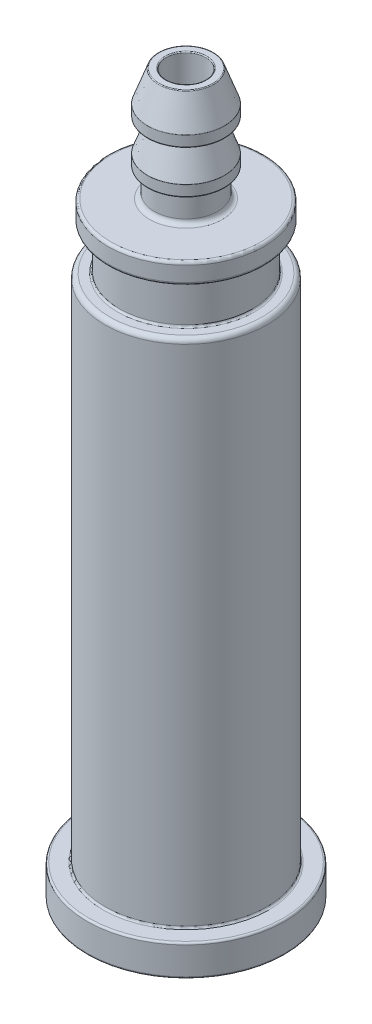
ISO-10303-21;
HEADER;
FILE_DESCRIPTION(('STEP AP214'),'2;1');
FILE_NAME('part.step','',(''),(''),'','','');
FILE_SCHEMA(('AUTOMOTIVE_DESIGN { 1 0 10303 214 1 1 1 1 }'));
ENDSEC;
DATA;
#1=APPLICATION_CONTEXT('core data for automotive mechanical design processes');
#2=APPLICATION_PROTOCOL_DEFINITION('international standard','automotive_design',2000,#1);
#3=PRODUCT_CONTEXT('',#1,'mechanical');
#4=PRODUCT('Part','Part','',(#3));
#5=PRODUCT_RELATED_PRODUCT_CATEGORY('part','',(#4));
#6=PRODUCT_DEFINITION_FORMATION('','',#4);
#7=PRODUCT_DEFINITION_CONTEXT('part definition',#1,'design');
#8=PRODUCT_DEFINITION('design','',#6,#7);
#9=PRODUCT_DEFINITION_SHAPE('','',#8);
#10=(LENGTH_UNIT() NAMED_UNIT(*) SI_UNIT(.MILLI.,.METRE.));
#11=(NAMED_UNIT(*) PLANE_ANGLE_UNIT() SI_UNIT($,.RADIAN.));
#12=(NAMED_UNIT(*) SI_UNIT($,.STERADIAN.) SOLID_ANGLE_UNIT());
#13=UNCERTAINTY_MEASURE_WITH_UNIT(LENGTH_MEASURE(1.E-05),#10,'distance_accuracy_value','');
#14=(GEOMETRIC_REPRESENTATION_CONTEXT(3) GLOBAL_UNCERTAINTY_ASSIGNED_CONTEXT((#13)) GLOBAL_UNIT_ASSIGNED_CONTEXT((#10,
#11,#12)) REPRESENTATION_CONTEXT('',''));
#15=CARTESIAN_POINT('',(0.,0.,0.));
#16=DIRECTION('',(0.,0.,1.));
#17=DIRECTION('',(1.,0.,0.));
#18=AXIS2_PLACEMENT_3D('',#15,#16,#17);
#19=CARTESIAN_POINT('',(7.62500000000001,0.5,0.));
#20=DIRECTION('',(0.,-1.,0.));
#21=DIRECTION('',(0.,0.,-1.));
#22=AXIS2_PLACEMENT_3D('',#19,#20,#21);
#23=PLANE('',#22);
#24=CARTESIAN_POINT('',(0.,0.5,0.));
#25=DIRECTION('',(0.,-1.,0.));
#26=DIRECTION('',(0.,0.,-1.));
#27=AXIS2_PLACEMENT_3D('',#24,#25,#26);
#28=CIRCLE('',#27,7.825);
#29=CARTESIAN_POINT('',(0.,0.5,-7.825));
#30=VERTEX_POINT('',#29);
#31=EDGE_CURVE('E58',#30,#30,#28,.F.);
#32=ORIENTED_EDGE('',*,*,#31,.T.);
#33=EDGE_LOOP('',(#32));
#34=FACE_BOUND('',#33,.T.);
#35=CARTESIAN_POINT('',(0.,0.5,0.));
#36=DIRECTION('',(0.,-1.,0.));
#37=DIRECTION('',(0.,0.,-1.));
#38=AXIS2_PLACEMENT_3D('',#35,#36,#37);
#39=CIRCLE('',#38,8.67759001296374);
#40=CARTESIAN_POINT('',(0.,0.5,-8.67759001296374));
#41=VERTEX_POINT('',#40);
#42=EDGE_CURVE('E61',#41,#41,#39,.T.);
#43=ORIENTED_EDGE('',*,*,#42,.T.);
#44=EDGE_LOOP('',(#43));
#45=FACE_BOUND('',#44,.T.);
#46=ADVANCED_FACE('F29',(#34,#45),#23,.T.);
#47=CARTESIAN_POINT('',(0.,0.5,0.));
#48=DIRECTION('',(0.,-1.,0.));
#49=DIRECTION('',(0.,0.,-1.));
#50=AXIS2_PLACEMENT_3D('',#47,#48,#49);
#51=CONICAL_SURFACE('',#50,8.75,0.876058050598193);
#52=CARTESIAN_POINT('',(0.,0.0463557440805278,0.));
#53=DIRECTION('',(0.,1.,0.));
#54=DIRECTION('',(0.,0.,1.));
#55=AXIS2_PLACEMENT_3D('',#52,#53,#54);
#56=CIRCLE('',#55,9.29437310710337);
#57=CARTESIAN_POINT('',(0.,0.0463557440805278,9.29437310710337));
#58=VERTEX_POINT('',#57);
#59=EDGE_CURVE('E79',#58,#58,#56,.F.);
#60=ORIENTED_EDGE('',*,*,#59,.T.);
#61=EDGE_LOOP('',(#60));
#62=FACE_BOUND('',#61,.T.);
#63=CARTESIAN_POINT('',(0.,0.453644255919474,0.));
#64=DIRECTION('',(0.,-1.,0.));
#65=DIRECTION('',(0.,0.,-1.));
#66=AXIS2_PLACEMENT_3D('',#63,#64,#65);
#67=CIRCLE('',#66,8.80562689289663);
#68=CARTESIAN_POINT('',(0.,0.453644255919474,-8.80562689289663));
#69=VERTEX_POINT('',#68);
#70=EDGE_CURVE('E82',#69,#69,#67,.F.);
#71=ORIENTED_EDGE('',*,*,#70,.T.);
#72=EDGE_LOOP('',(#71));
#73=FACE_BOUND('',#72,.T.);
#74=ADVANCED_FACE('F203',(#62,#73),#51,.F.);
#75=CARTESIAN_POINT('',(9.35,0.,0.));
#76=DIRECTION('',(0.,-1.,0.));
#77=DIRECTION('',(0.,0.,-1.));
#78=AXIS2_PLACEMENT_3D('',#75,#76,#77);
#79=PLANE('',#78);
#80=CARTESIAN_POINT('',(0.,0.,0.));
#81=DIRECTION('',(0.,-1.,0.));
#82=DIRECTION('',(0.,0.,-1.));
#83=AXIS2_PLACEMENT_3D('',#80,#81,#82);
#84=CIRCLE('',#83,9.42240998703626);
#85=CARTESIAN_POINT('',(0.,0.,-9.42240998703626));
#86=VERTEX_POINT('',#85);
#87=EDGE_CURVE('E73',#86,#86,#84,.F.);
#88=ORIENTED_EDGE('',*,*,#87,.T.);
#89=EDGE_LOOP('',(#88));
#90=FACE_BOUND('',#89,.T.);
#91=CARTESIAN_POINT('',(0.,0.,0.));
#92=DIRECTION('',(0.,-1.,0.));
#93=DIRECTION('',(0.,0.,-1.));
#94=AXIS2_PLACEMENT_3D('',#91,#92,#93);
#95=CIRCLE('',#94,9.57759001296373);
#96=CARTESIAN_POINT('',(0.,0.,-9.57759001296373));
#97=VERTEX_POINT('',#96);
#98=EDGE_CURVE('E76',#97,#97,#95,.T.);
#99=ORIENTED_EDGE('',*,*,#98,.T.);
#100=EDGE_LOOP('',(#99));
#101=FACE_BOUND('',#100,.T.);
#102=ADVANCED_FACE('F209',(#90,#101),#79,.T.);
#103=CARTESIAN_POINT('',(0.,0.,0.));
#104=DIRECTION('',(0.,1.,0.));
#105=DIRECTION('',(0.,0.,1.));
#106=AXIS2_PLACEMENT_3D('',#103,#104,#105);
#107=CONICAL_SURFACE('',#106,9.65,0.876058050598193);
#108=CARTESIAN_POINT('',(0.,0.0463557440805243,0.));
#109=DIRECTION('',(0.,-1.,0.));
#110=DIRECTION('',(0.,0.,-1.));
#111=AXIS2_PLACEMENT_3D('',#108,#109,#110);
#112=CIRCLE('',#111,9.70562689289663);
#113=CARTESIAN_POINT('',(0.,0.0463557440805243,-9.70562689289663));
#114=VERTEX_POINT('',#113);
#115=EDGE_CURVE('E67',#114,#114,#112,.F.);
#116=ORIENTED_EDGE('',*,*,#115,.T.);
#117=EDGE_LOOP('',(#116));
#118=FACE_BOUND('',#117,.T.);
#119=CARTESIAN_POINT('',(0.,0.453644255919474,0.));
#120=DIRECTION('',(0.,1.,0.));
#121=DIRECTION('',(0.,0.,1.));
#122=AXIS2_PLACEMENT_3D('',#119,#120,#121);
#123=CIRCLE('',#122,10.1943731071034);
#124=CARTESIAN_POINT('',(0.,0.453644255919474,10.1943731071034));
#125=VERTEX_POINT('',#124);
#126=EDGE_CURVE('E70',#125,#125,#123,.F.);
#127=ORIENTED_EDGE('',*,*,#126,.T.);
#128=EDGE_LOOP('',(#127));
#129=FACE_BOUND('',#128,.T.);
#130=ADVANCED_FACE('F311',(#118,#129),#107,.T.);
#131=CARTESIAN_POINT('',(10.25,0.5,0.));
#132=DIRECTION('',(0.,-1.,0.));
#133=DIRECTION('',(0.,0.,-1.));
#134=AXIS2_PLACEMENT_3D('',#131,#132,#133);
#135=PLANE('',#134);
#136=CARTESIAN_POINT('',(0.,0.5,0.));
#137=DIRECTION('',(0.,-1.,0.));
#138=DIRECTION('',(0.,0.,-1.));
#139=AXIS2_PLACEMENT_3D('',#136,#137,#138);
#140=CIRCLE('',#139,10.3224099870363);
#141=CARTESIAN_POINT('',(0.,0.5,-10.3224099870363));
#142=VERTEX_POINT('',#141);
#143=EDGE_CURVE('E52',#142,#142,#140,.F.);
#144=ORIENTED_EDGE('',*,*,#143,.T.);
#145=EDGE_LOOP('',(#144));
#146=FACE_BOUND('',#145,.T.);
#147=CARTESIAN_POINT('',(0.,0.5,0.));
#148=DIRECTION('',(0.,-1.,0.));
#149=DIRECTION('',(0.,0.,-1.));
#150=AXIS2_PLACEMENT_3D('',#147,#148,#149);
#151=CIRCLE('',#150,10.4);
#152=CARTESIAN_POINT('',(0.,0.5,-10.4));
#153=VERTEX_POINT('',#152);
#154=EDGE_CURVE('E55',#153,#153,#151,.T.);
#155=ORIENTED_EDGE('',*,*,#154,.T.);
#156=EDGE_LOOP('',(#155));
#157=FACE_BOUND('',#156,.T.);
#158=ADVANCED_FACE('F302',(#146,#157),#135,.T.);
#159=CARTESIAN_POINT('',(0.,0.,0.));
#160=DIRECTION('',(0.,-1.,0.));
#161=DIRECTION('',(0.,0.,-1.));
#162=AXIS2_PLACEMENT_3D('',#159,#160,#161);
#163=CYLINDRICAL_SURFACE('',#162,10.6);
#164=CARTESIAN_POINT('',(0.,0.7,0.));
#165=DIRECTION('',(0.,-1.,0.));
#166=DIRECTION('',(0.,0.,-1.));
#167=AXIS2_PLACEMENT_3D('',#164,#165,#166);
#168=CIRCLE('',#167,10.6);
#169=CARTESIAN_POINT('',(0.,0.7,-10.6));
#170=VERTEX_POINT('',#169);
#171=EDGE_CURVE('E44',#170,#170,#168,.F.);
#172=ORIENTED_EDGE('',*,*,#171,.T.);
#173=EDGE_LOOP('',(#172));
#174=FACE_BOUND('',#173,.T.);
#175=CARTESIAN_POINT('',(0.,3.65,0.));
#176=DIRECTION('',(0.,1.,0.));
#177=DIRECTION('',(0.,0.,1.));
#178=AXIS2_PLACEMENT_3D('',#175,#176,#177);
#179=CIRCLE('',#178,10.6);
#180=CARTESIAN_POINT('',(0.,3.65,10.6));
#181=VERTEX_POINT('',#180);
#182=EDGE_CURVE('E49',#181,#181,#179,.F.);
#183=ORIENTED_EDGE('',*,*,#182,.T.);
#184=EDGE_LOOP('',(#183));
#185=FACE_BOUND('',#184,.T.);
#186=ADVANCED_FACE('F299',(#174,#185),#163,.T.);
#187=CARTESIAN_POINT('',(10.6,3.85,0.));
#188=DIRECTION('',(0.,1.,0.));
#189=DIRECTION('',(0.,0.,1.));
#190=AXIS2_PLACEMENT_3D('',#187,#188,#189);
#191=PLANE('',#190);
#192=CARTESIAN_POINT('',(0.,3.85,0.));
#193=DIRECTION('',(0.,1.,0.));
#194=DIRECTION('',(0.,0.,1.));
#195=AXIS2_PLACEMENT_3D('',#192,#193,#194);
#196=CIRCLE('',#195,10.4);
#197=CARTESIAN_POINT('',(0.,3.85,10.4));
#198=VERTEX_POINT('',#197);
#199=EDGE_CURVE('E36',#198,#198,#196,.T.);
#200=ORIENTED_EDGE('',*,*,#199,.T.);
#201=EDGE_LOOP('',(#200));
#202=FACE_BOUND('',#201,.T.);
#203=CARTESIAN_POINT('',(0.,3.85,0.));
#204=DIRECTION('',(0.,1.,0.));
#205=DIRECTION('',(0.,0.,1.));
#206=AXIS2_PLACEMENT_3D('',#203,#204,#205);
#207=CIRCLE('',#206,8.875);
#208=CARTESIAN_POINT('',(0.,3.85,8.875));
#209=VERTEX_POINT('',#208);
#210=EDGE_CURVE('E40',#209,#209,#207,.F.);
#211=ORIENTED_EDGE('',*,*,#210,.T.);
#212=EDGE_LOOP('',(#211));
#213=FACE_BOUND('',#212,.T.);
#214=ADVANCED_FACE('F301',(#202,#213),#191,.T.);
#215=CARTESIAN_POINT('',(0.,0.,0.));
#216=DIRECTION('',(0.,-1.,0.));
#217=DIRECTION('',(0.,0.,-1.));
#218=AXIS2_PLACEMENT_3D('',#215,#216,#217);
#219=CYLINDRICAL_SURFACE('',#218,8.675);
#220=CARTESIAN_POINT('',(0.,4.05,0.));
#221=DIRECTION('',(0.,1.,0.));
#222=DIRECTION('',(0.,0.,1.));
#223=AXIS2_PLACEMENT_3D('',#220,#221,#222);
#224=CIRCLE('',#223,8.675);
#225=CARTESIAN_POINT('',(0.,4.05,8.675));
#226=VERTEX_POINT('',#225);
#227=EDGE_CURVE('E10',#226,#226,#224,.T.);
#228=ORIENTED_EDGE('',*,*,#227,.T.);
#229=EDGE_LOOP('',(#228));
#230=FACE_BOUND('',#229,.T.);
#231=CARTESIAN_POINT('',(0.,58.,0.));
#232=DIRECTION('',(0.,1.,0.));
#233=DIRECTION('',(0.,0.,1.));
#234=AXIS2_PLACEMENT_3D('',#231,#232,#233);
#235=CIRCLE('',#234,8.675);
#236=CARTESIAN_POINT('',(0.,58.,8.675));
#237=VERTEX_POINT('',#236);
#238=EDGE_CURVE('E142',#237,#237,#235,.F.);
#239=ORIENTED_EDGE('',*,*,#238,.T.);
#240=EDGE_LOOP('',(#239));
#241=FACE_BOUND('',#240,.T.);
#242=ADVANCED_FACE('F309',(#230,#241),#219,.T.);
#243=CARTESIAN_POINT('',(8.675,58.5,0.));
#244=DIRECTION('',(0.,1.,0.));
#245=DIRECTION('',(0.,0.,1.));
#246=AXIS2_PLACEMENT_3D('',#243,#244,#245);
#247=PLANE('',#246);
#248=CARTESIAN_POINT('',(0.,58.5,0.));
#249=DIRECTION('',(0.,1.,0.));
#250=DIRECTION('',(0.,0.,1.));
#251=AXIS2_PLACEMENT_3D('',#248,#249,#250);
#252=CIRCLE('',#251,8.175);
#253=CARTESIAN_POINT('',(0.,58.5,8.175));
#254=VERTEX_POINT('',#253);
#255=EDGE_CURVE('E139',#254,#254,#252,.T.);
#256=ORIENTED_EDGE('',*,*,#255,.T.);
#257=EDGE_LOOP('',(#256));
#258=FACE_BOUND('',#257,.T.);
#259=CARTESIAN_POINT('',(0.,58.5,0.));
#260=DIRECTION('',(0.,1.,0.));
#261=DIRECTION('',(0.,0.,1.));
#262=AXIS2_PLACEMENT_3D('',#259,#260,#261);
#263=CIRCLE('',#262,7.3);
#264=CARTESIAN_POINT('',(0.,58.5,7.3));
#265=VERTEX_POINT('',#264);
#266=EDGE_CURVE('E154',#265,#265,#263,.F.);
#267=ORIENTED_EDGE('',*,*,#266,.T.);
#268=EDGE_LOOP('',(#267));
#269=FACE_BOUND('',#268,.T.);
#270=ADVANCED_FACE('F360',(#258,#269),#247,.T.);
#271=CARTESIAN_POINT('',(0.,0.,0.));
#272=DIRECTION('',(0.,-1.,0.));
#273=DIRECTION('',(0.,0.,-1.));
#274=AXIS2_PLACEMENT_3D('',#271,#272,#273);
#275=CYLINDRICAL_SURFACE('',#274,7.1);
#276=CARTESIAN_POINT('',(0.,58.7,0.));
#277=DIRECTION('',(0.,1.,0.));
#278=DIRECTION('',(0.,0.,1.));
#279=AXIS2_PLACEMENT_3D('',#276,#277,#278);
#280=CIRCLE('',#279,7.1);
#281=CARTESIAN_POINT('',(0.,58.7,7.1));
#282=VERTEX_POINT('',#281);
#283=EDGE_CURVE('E148',#282,#282,#280,.T.);
#284=ORIENTED_EDGE('',*,*,#283,.T.);
#285=EDGE_LOOP('',(#284));
#286=FACE_BOUND('',#285,.T.);
#287=CARTESIAN_POINT('',(0.,63.,0.));
#288=DIRECTION('',(0.,-1.,0.));
#289=DIRECTION('',(0.,0.,-1.));
#290=AXIS2_PLACEMENT_3D('',#287,#288,#289);
#291=CIRCLE('',#290,7.1);
#292=CARTESIAN_POINT('',(0.,63.,-7.1));
#293=VERTEX_POINT('',#292);
#294=EDGE_CURVE('E151',#293,#293,#291,.T.);
#295=ORIENTED_EDGE('',*,*,#294,.T.);
#296=EDGE_LOOP('',(#295));
#297=FACE_BOUND('',#296,.T.);
#298=ADVANCED_FACE('F628',(#286,#297),#275,.T.);
#299=CARTESIAN_POINT('',(7.1,63.2,0.));
#300=DIRECTION('',(0.,-1.,0.));
#301=DIRECTION('',(0.,0.,-1.));
#302=AXIS2_PLACEMENT_3D('',#299,#300,#301);
#303=PLANE('',#302);
#304=CARTESIAN_POINT('',(0.,63.2,0.));
#305=DIRECTION('',(0.,-1.,0.));
#306=DIRECTION('',(0.,0.,-1.));
#307=AXIS2_PLACEMENT_3D('',#304,#305,#306);
#308=CIRCLE('',#307,7.3);
#309=CARTESIAN_POINT('',(0.,63.2,-7.3));
#310=VERTEX_POINT('',#309);
#311=EDGE_CURVE('E145',#310,#310,#308,.F.);
#312=ORIENTED_EDGE('',*,*,#311,.T.);
#313=EDGE_LOOP('',(#312));
#314=FACE_BOUND('',#313,.T.);
#315=CARTESIAN_POINT('',(0.,63.2,0.));
#316=DIRECTION('',(0.,-1.,0.));
#317=DIRECTION('',(0.,0.,-1.));
#318=AXIS2_PLACEMENT_3D('',#315,#316,#317);
#319=CIRCLE('',#318,8.05);
#320=CARTESIAN_POINT('',(0.,63.2,-8.05));
#321=VERTEX_POINT('',#320);
#322=EDGE_CURVE('E166',#321,#321,#319,.T.);
#323=ORIENTED_EDGE('',*,*,#322,.T.);
#324=EDGE_LOOP('',(#323));
#325=FACE_BOUND('',#324,.T.);
#326=ADVANCED_FACE('F488',(#314,#325),#303,.T.);
#327=CARTESIAN_POINT('',(0.,0.,0.));
#328=DIRECTION('',(0.,-1.,0.));
#329=DIRECTION('',(0.,0.,-1.));
#330=AXIS2_PLACEMENT_3D('',#327,#328,#329);
#331=CYLINDRICAL_SURFACE('',#330,8.35);
#332=CARTESIAN_POINT('',(0.,63.5,0.));
#333=DIRECTION('',(0.,-1.,0.));
#334=DIRECTION('',(0.,0.,-1.));
#335=AXIS2_PLACEMENT_3D('',#332,#333,#334);
#336=CIRCLE('',#335,8.35);
#337=CARTESIAN_POINT('',(0.,63.5,-8.35));
#338=VERTEX_POINT('',#337);
#339=EDGE_CURVE('E160',#338,#338,#336,.F.);
#340=ORIENTED_EDGE('',*,*,#339,.T.);
#341=EDGE_LOOP('',(#340));
#342=FACE_BOUND('',#341,.T.);
#343=CARTESIAN_POINT('',(0.,65.1,0.));
#344=DIRECTION('',(0.,1.,0.));
#345=DIRECTION('',(0.,0.,1.));
#346=AXIS2_PLACEMENT_3D('',#343,#344,#345);
#347=CIRCLE('',#346,8.35);
#348=CARTESIAN_POINT('',(0.,65.1,8.35));
#349=VERTEX_POINT('',#348);
#350=EDGE_CURVE('E163',#349,#349,#347,.F.);
#351=ORIENTED_EDGE('',*,*,#350,.T.);
#352=EDGE_LOOP('',(#351));
#353=FACE_BOUND('',#352,.T.);
#354=ADVANCED_FACE('F482',(#342,#353),#331,.T.);
#355=CARTESIAN_POINT('',(8.35,65.4,0.));
#356=DIRECTION('',(0.,1.,0.));
#357=DIRECTION('',(0.,0.,1.));
#358=AXIS2_PLACEMENT_3D('',#355,#356,#357);
#359=PLANE('',#358);
#360=CARTESIAN_POINT('',(0.,65.4,0.));
#361=DIRECTION('',(0.,1.,0.));
#362=DIRECTION('',(0.,0.,1.));
#363=AXIS2_PLACEMENT_3D('',#360,#361,#362);
#364=CIRCLE('',#363,3.9);
#365=CARTESIAN_POINT('',(0.,65.4,3.9));
#366=VERTEX_POINT('',#365);
#367=EDGE_CURVE('E136',#366,#366,#364,.F.);
#368=ORIENTED_EDGE('',*,*,#367,.T.);
#369=EDGE_LOOP('',(#368));
#370=FACE_BOUND('',#369,.T.);
#371=CARTESIAN_POINT('',(0.,65.4,0.));
#372=DIRECTION('',(0.,1.,0.));
#373=DIRECTION('',(0.,0.,1.));
#374=AXIS2_PLACEMENT_3D('',#371,#372,#373);
#375=CIRCLE('',#374,8.05);
#376=CARTESIAN_POINT('',(0.,65.4,8.05));
#377=VERTEX_POINT('',#376);
#378=EDGE_CURVE('E157',#377,#377,#375,.T.);
#379=ORIENTED_EDGE('',*,*,#378,.T.);
#380=EDGE_LOOP('',(#379));
#381=FACE_BOUND('',#380,.T.);
#382=ADVANCED_FACE('F487',(#370,#381),#359,.T.);
#383=CARTESIAN_POINT('',(0.,0.,0.));
#384=DIRECTION('',(0.,-1.,0.));
#385=DIRECTION('',(0.,0.,-1.));
#386=AXIS2_PLACEMENT_3D('',#383,#384,#385);
#387=CYLINDRICAL_SURFACE('',#386,3.4);
#388=CARTESIAN_POINT('',(0.,68.3,0.));
#389=DIRECTION('',(0.,-1.,0.));
#390=DIRECTION('',(0.,0.,-1.));
#391=AXIS2_PLACEMENT_3D('',#388,#389,#390);
#392=CIRCLE('',#391,3.4);
#393=CARTESIAN_POINT('',(0.,68.3,-3.4));
#394=VERTEX_POINT('',#393);
#395=EDGE_CURVE('E109',#394,#394,#392,.T.);
#396=ORIENTED_EDGE('',*,*,#395,.T.);
#397=EDGE_LOOP('',(#396));
#398=FACE_BOUND('',#397,.T.);
#399=CARTESIAN_POINT('',(0.,65.9,0.));
#400=DIRECTION('',(0.,1.,0.));
#401=DIRECTION('',(0.,0.,1.));
#402=AXIS2_PLACEMENT_3D('',#399,#400,#401);
#403=CIRCLE('',#402,3.4);
#404=CARTESIAN_POINT('',(0.,65.9,3.4));
#405=VERTEX_POINT('',#404);
#406=EDGE_CURVE('E133',#405,#405,#403,.T.);
#407=ORIENTED_EDGE('',*,*,#406,.T.);
#408=EDGE_LOOP('',(#407));
#409=FACE_BOUND('',#408,.T.);
#410=ADVANCED_FACE('F589',(#398,#409),#387,.T.);
#411=CARTESIAN_POINT('',(3.4,68.4,0.));
#412=DIRECTION('',(0.,-1.,0.));
#413=DIRECTION('',(0.,0.,-1.));
#414=AXIS2_PLACEMENT_3D('',#411,#412,#413);
#415=PLANE('',#414);
#416=CARTESIAN_POINT('',(0.,68.4,0.));
#417=DIRECTION('',(0.,-1.,0.));
#418=DIRECTION('',(0.,0.,-1.));
#419=AXIS2_PLACEMENT_3D('',#416,#417,#418);
#420=CIRCLE('',#419,4.025);
#421=CARTESIAN_POINT('',(0.,68.4,-4.025));
#422=VERTEX_POINT('',#421);
#423=EDGE_CURVE('E118',#422,#422,#420,.T.);
#424=ORIENTED_EDGE('',*,*,#423,.T.);
#425=EDGE_LOOP('',(#424));
#426=FACE_BOUND('',#425,.T.);
#427=CARTESIAN_POINT('',(0.,68.4,0.));
#428=DIRECTION('',(0.,-1.,0.));
#429=DIRECTION('',(0.,0.,-1.));
#430=AXIS2_PLACEMENT_3D('',#427,#428,#429);
#431=CIRCLE('',#430,3.5);
#432=CARTESIAN_POINT('',(0.,68.4,-3.5));
#433=VERTEX_POINT('',#432);
#434=EDGE_CURVE('E121',#433,#433,#431,.F.);
#435=ORIENTED_EDGE('',*,*,#434,.T.);
#436=EDGE_LOOP('',(#435));
#437=FACE_BOUND('',#436,.T.);
#438=ADVANCED_FACE('F581',(#426,#437),#415,.T.);
#439=CARTESIAN_POINT('',(0.,0.,0.));
#440=DIRECTION('',(0.,-1.,0.));
#441=DIRECTION('',(0.,0.,-1.));
#442=AXIS2_PLACEMENT_3D('',#439,#440,#441);
#443=CYLINDRICAL_SURFACE('',#442,4.125);
#444=CARTESIAN_POINT('',(0.,68.5,0.));
#445=DIRECTION('',(0.,-1.,0.));
#446=DIRECTION('',(0.,0.,-1.));
#447=AXIS2_PLACEMENT_3D('',#444,#445,#446);
#448=CIRCLE('',#447,4.125);
#449=CARTESIAN_POINT('',(0.,68.5,-4.125));
#450=VERTEX_POINT('',#449);
#451=EDGE_CURVE('E112',#450,#450,#448,.F.);
#452=ORIENTED_EDGE('',*,*,#451,.T.);
#453=EDGE_LOOP('',(#452));
#454=FACE_BOUND('',#453,.T.);
#455=CARTESIAN_POINT('',(0.,69.5823673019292,0.));
#456=DIRECTION('',(0.,1.,0.));
#457=DIRECTION('',(0.,0.,1.));
#458=AXIS2_PLACEMENT_3D('',#455,#456,#457);
#459=CIRCLE('',#458,4.125);
#460=CARTESIAN_POINT('',(0.,69.5823673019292,4.125));
#461=VERTEX_POINT('',#460);
#462=EDGE_CURVE('E115',#461,#461,#459,.F.);
#463=ORIENTED_EDGE('',*,*,#462,.T.);
#464=EDGE_LOOP('',(#463));
#465=FACE_BOUND('',#464,.T.);
#466=ADVANCED_FACE('F573',(#454,#465),#443,.T.);
#467=CARTESIAN_POINT('',(0.,69.6,0.));
#468=DIRECTION('',(0.,-1.,0.));
#469=DIRECTION('',(0.,0.,-1.));
#470=AXIS2_PLACEMENT_3D('',#467,#468,#469);
#471=CONICAL_SURFACE('',#470,4.125,0.349065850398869);
#472=CARTESIAN_POINT('',(0.,69.6165693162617,0.));
#473=DIRECTION('',(0.,1.,0.));
#474=DIRECTION('',(0.,0.,1.));
#475=AXIS2_PLACEMENT_3D('',#472,#473,#474);
#476=CIRCLE('',#475,4.1189692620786);
#477=CARTESIAN_POINT('',(0.,69.6165693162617,4.1189692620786));
#478=VERTEX_POINT('',#477);
#479=EDGE_CURVE('E106',#478,#478,#476,.T.);
#480=ORIENTED_EDGE('',*,*,#479,.T.);
#481=EDGE_LOOP('',(#480));
#482=FACE_BOUND('',#481,.T.);
#483=CARTESIAN_POINT('',(0.,72.5,0.));
#484=DIRECTION('',(0.,-1.,0.));
#485=DIRECTION('',(0.,0.,-1.));
#486=AXIS2_PLACEMENT_3D('',#483,#484,#485);
#487=CIRCLE('',#486,3.06948632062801);
#488=CARTESIAN_POINT('',(0.,72.5,-3.06948632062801));
#489=VERTEX_POINT('',#488);
#490=EDGE_CURVE('E169',#489,#489,#487,.T.);
#491=ORIENTED_EDGE('',*,*,#490,.T.);
#492=EDGE_LOOP('',(#491));
#493=FACE_BOUND('',#492,.T.);
#494=ADVANCED_FACE('F565',(#482,#493),#471,.T.);
#495=CARTESIAN_POINT('',(0.,0.,0.));
#496=DIRECTION('',(0.,-1.,0.));
#497=DIRECTION('',(0.,0.,-1.));
#498=AXIS2_PLACEMENT_3D('',#495,#496,#497);
#499=CYLINDRICAL_SURFACE('',#498,3.06948632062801);
#500=CARTESIAN_POINT('',(0.,72.9,0.));
#501=DIRECTION('',(0.,-1.,0.));
#502=DIRECTION('',(0.,0.,-1.));
#503=AXIS2_PLACEMENT_3D('',#500,#501,#502);
#504=CIRCLE('',#503,3.06948632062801);
#505=CARTESIAN_POINT('',(0.,72.9,-3.06948632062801));
#506=VERTEX_POINT('',#505);
#507=EDGE_CURVE('E130',#506,#506,#504,.T.);
#508=ORIENTED_EDGE('',*,*,#507,.T.);
#509=EDGE_LOOP('',(#508));
#510=FACE_BOUND('',#509,.T.);
#511=ORIENTED_EDGE('',*,*,#490,.F.);
#512=EDGE_LOOP('',(#511));
#513=FACE_BOUND('',#512,.T.);
#514=ADVANCED_FACE('F557',(#510,#513),#499,.T.);
#515=CARTESIAN_POINT('',(3.06948632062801,73.,0.));
#516=DIRECTION('',(0.,-1.,0.));
#517=DIRECTION('',(0.,0.,-1.));
#518=AXIS2_PLACEMENT_3D('',#515,#516,#517);
#519=PLANE('',#518);
#520=CARTESIAN_POINT('',(0.,73.,0.));
#521=DIRECTION('',(0.,-1.,0.));
#522=DIRECTION('',(0.,0.,-1.));
#523=AXIS2_PLACEMENT_3D('',#520,#521,#522);
#524=CIRCLE('',#523,3.16948632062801);
#525=CARTESIAN_POINT('',(0.,73.,-3.16948632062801));
#526=VERTEX_POINT('',#525);
#527=EDGE_CURVE('E124',#526,#526,#524,.F.);
#528=ORIENTED_EDGE('',*,*,#527,.T.);
#529=EDGE_LOOP('',(#528));
#530=FACE_BOUND('',#529,.T.);
#531=CARTESIAN_POINT('',(0.,73.,0.));
#532=DIRECTION('',(0.,-1.,0.));
#533=DIRECTION('',(0.,0.,-1.));
#534=AXIS2_PLACEMENT_3D('',#531,#532,#533);
#535=CIRCLE('',#534,4.025);
#536=CARTESIAN_POINT('',(0.,73.,-4.025));
#537=VERTEX_POINT('',#536);
#538=EDGE_CURVE('E127',#537,#537,#535,.T.);
#539=ORIENTED_EDGE('',*,*,#538,.T.);
#540=EDGE_LOOP('',(#539));
#541=FACE_BOUND('',#540,.T.);
#542=ADVANCED_FACE('F549',(#530,#541),#519,.T.);
#543=CARTESIAN_POINT('',(0.,0.,0.));
#544=DIRECTION('',(0.,-1.,0.));
#545=DIRECTION('',(0.,0.,-1.));
#546=AXIS2_PLACEMENT_3D('',#543,#544,#545);
#547=CYLINDRICAL_SURFACE('',#546,4.125);
#548=CARTESIAN_POINT('',(0.,73.1,0.));
#549=DIRECTION('',(0.,-1.,0.));
#550=DIRECTION('',(0.,0.,-1.));
#551=AXIS2_PLACEMENT_3D('',#548,#549,#550);
#552=CIRCLE('',#551,4.125);
#553=CARTESIAN_POINT('',(0.,73.1,-4.125));
#554=VERTEX_POINT('',#553);
#555=EDGE_CURVE('E100',#554,#554,#552,.F.);
#556=ORIENTED_EDGE('',*,*,#555,.T.);
#557=EDGE_LOOP('',(#556));
#558=FACE_BOUND('',#557,.T.);
#559=CARTESIAN_POINT('',(0.,74.1823673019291,0.));
#560=DIRECTION('',(0.,1.,0.));
#561=DIRECTION('',(0.,0.,1.));
#562=AXIS2_PLACEMENT_3D('',#559,#560,#561);
#563=CIRCLE('',#562,4.125);
#564=CARTESIAN_POINT('',(0.,74.1823673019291,4.125));
#565=VERTEX_POINT('',#564);
#566=EDGE_CURVE('E103',#565,#565,#563,.F.);
#567=ORIENTED_EDGE('',*,*,#566,.T.);
#568=EDGE_LOOP('',(#567));
#569=FACE_BOUND('',#568,.T.);
#570=ADVANCED_FACE('F541',(#558,#569),#547,.T.);
#571=CARTESIAN_POINT('',(0.,74.2,0.));
#572=DIRECTION('',(0.,-1.,0.));
#573=DIRECTION('',(0.,0.,-1.));
#574=AXIS2_PLACEMENT_3D('',#571,#572,#573);
#575=CONICAL_SURFACE('',#574,4.125,0.349065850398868);
#576=CARTESIAN_POINT('',(0.,74.2165693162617,0.));
#577=DIRECTION('',(0.,1.,0.));
#578=DIRECTION('',(0.,0.,1.));
#579=AXIS2_PLACEMENT_3D('',#576,#577,#578);
#580=CIRCLE('',#579,4.11896926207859);
#581=CARTESIAN_POINT('',(0.,74.2165693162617,4.11896926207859));
#582=VERTEX_POINT('',#581);
#583=EDGE_CURVE('E94',#582,#582,#580,.T.);
#584=ORIENTED_EDGE('',*,*,#583,.T.);
#585=EDGE_LOOP('',(#584));
#586=FACE_BOUND('',#585,.T.);
#587=CARTESIAN_POINT('',(0.,77.4342020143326,0.));
#588=DIRECTION('',(0.,1.,0.));
#589=DIRECTION('',(0.,0.,1.));
#590=AXIS2_PLACEMENT_3D('',#587,#588,#589);
#591=CIRCLE('',#590,2.94784673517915);
#592=CARTESIAN_POINT('',(0.,77.4342020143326,2.94784673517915));
#593=VERTEX_POINT('',#592);
#594=EDGE_CURVE('E97',#593,#593,#591,.F.);
#595=ORIENTED_EDGE('',*,*,#594,.T.);
#596=EDGE_LOOP('',(#595));
#597=FACE_BOUND('',#596,.T.);
#598=ADVANCED_FACE('F533',(#586,#597),#575,.T.);
#599=CARTESIAN_POINT('',(2.92389822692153,77.5,0.));
#600=DIRECTION('',(0.,1.,0.));
#601=DIRECTION('',(0.,0.,1.));
#602=AXIS2_PLACEMENT_3D('',#599,#600,#601);
#603=PLANE('',#602);
#604=CARTESIAN_POINT('',(0.,77.5,0.));
#605=DIRECTION('',(0.,1.,0.));
#606=DIRECTION('',(0.,0.,1.));
#607=AXIS2_PLACEMENT_3D('',#604,#605,#606);
#608=CIRCLE('',#607,2.85387747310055);
#609=CARTESIAN_POINT('',(0.,77.5,2.85387747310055));
#610=VERTEX_POINT('',#609);
#611=EDGE_CURVE('E88',#610,#610,#608,.T.);
#612=ORIENTED_EDGE('',*,*,#611,.T.);
#613=EDGE_LOOP('',(#612));
#614=FACE_BOUND('',#613,.T.);
#615=CARTESIAN_POINT('',(0.,77.5,0.));
#616=DIRECTION('',(0.,1.,0.));
#617=DIRECTION('',(0.,0.,1.));
#618=AXIS2_PLACEMENT_3D('',#615,#616,#617);
#619=CIRCLE('',#618,2.225);
#620=CARTESIAN_POINT('',(0.,77.5,2.225));
#621=VERTEX_POINT('',#620);
#622=EDGE_CURVE('E91',#621,#621,#619,.F.);
#623=ORIENTED_EDGE('',*,*,#622,.T.);
#624=EDGE_LOOP('',(#623));
#625=FACE_BOUND('',#624,.T.);
#626=ADVANCED_FACE('F526',(#614,#625),#603,.T.);
#627=CARTESIAN_POINT('',(0.,0.,0.));
#628=DIRECTION('',(0.,-1.,0.));
#629=DIRECTION('',(0.,0.,-1.));
#630=AXIS2_PLACEMENT_3D('',#627,#628,#629);
#631=CYLINDRICAL_SURFACE('',#630,2.125);
#632=CARTESIAN_POINT('',(0.,77.4,0.));
#633=DIRECTION('',(0.,1.,0.));
#634=DIRECTION('',(0.,0.,1.));
#635=AXIS2_PLACEMENT_3D('',#632,#633,#634);
#636=CIRCLE('',#635,2.125);
#637=CARTESIAN_POINT('',(0.,77.4,2.125));
#638=VERTEX_POINT('',#637);
#639=EDGE_CURVE('E85',#638,#638,#636,.T.);
#640=ORIENTED_EDGE('',*,*,#639,.T.);
#641=EDGE_LOOP('',(#640));
#642=FACE_BOUND('',#641,.T.);
#643=CARTESIAN_POINT('',(0.,63.4,0.));
#644=DIRECTION('',(0.,-1.,0.));
#645=DIRECTION('',(0.,0.,-1.));
#646=AXIS2_PLACEMENT_3D('',#643,#644,#645);
#647=CIRCLE('',#646,2.125);
#648=CARTESIAN_POINT('',(0.,63.4,-2.125));
#649=VERTEX_POINT('',#648);
#650=EDGE_CURVE('E172',#649,#649,#647,.T.);
#651=ORIENTED_EDGE('',*,*,#650,.T.);
#652=EDGE_LOOP('',(#651));
#653=FACE_BOUND('',#652,.T.);
#654=ADVANCED_FACE('F516',(#642,#653),#631,.F.);
#655=CARTESIAN_POINT('',(4.5,63.4,0.));
#656=DIRECTION('',(0.,-1.,0.));
#657=DIRECTION('',(0.,0.,-1.));
#658=AXIS2_PLACEMENT_3D('',#655,#656,#657);
#659=PLANE('',#658);
#660=CARTESIAN_POINT('',(0.,63.4,0.));
#661=DIRECTION('',(0.,-1.,0.));
#662=DIRECTION('',(0.,0.,-1.));
#663=AXIS2_PLACEMENT_3D('',#660,#661,#662);
#664=CIRCLE('',#663,4.5);
#665=CARTESIAN_POINT('',(0.,63.4,-4.5));
#666=VERTEX_POINT('',#665);
#667=EDGE_CURVE('E175',#666,#666,#664,.T.);
#668=ORIENTED_EDGE('',*,*,#667,.T.);
#669=EDGE_LOOP('',(#668));
#670=FACE_BOUND('',#669,.T.);
#671=ORIENTED_EDGE('',*,*,#650,.F.);
#672=EDGE_LOOP('',(#671));
#673=FACE_BOUND('',#672,.T.);
#674=ADVANCED_FACE('F507',(#670,#673),#659,.T.);
#675=CARTESIAN_POINT('',(0.,0.,0.));
#676=DIRECTION('',(0.,-1.,0.));
#677=DIRECTION('',(0.,0.,-1.));
#678=AXIS2_PLACEMENT_3D('',#675,#676,#677);
#679=CYLINDRICAL_SURFACE('',#678,4.5);
#680=CARTESIAN_POINT('',(0.,53.4,0.));
#681=DIRECTION('',(0.,-1.,0.));
#682=DIRECTION('',(0.,0.,-1.));
#683=AXIS2_PLACEMENT_3D('',#680,#681,#682);
#684=CIRCLE('',#683,4.5);
#685=CARTESIAN_POINT('',(0.,53.4,-4.5));
#686=VERTEX_POINT('',#685);
#687=EDGE_CURVE('E178',#686,#686,#684,.T.);
#688=ORIENTED_EDGE('',*,*,#687,.T.);
#689=EDGE_LOOP('',(#688));
#690=FACE_BOUND('',#689,.T.);
#691=ORIENTED_EDGE('',*,*,#667,.F.);
#692=EDGE_LOOP('',(#691));
#693=FACE_BOUND('',#692,.T.);
#694=ADVANCED_FACE('F200',(#690,#693),#679,.F.);
#695=CARTESIAN_POINT('',(4.5,53.4,0.));
#696=DIRECTION('',(0.,-1.,0.));
#697=DIRECTION('',(0.,0.,-1.));
#698=AXIS2_PLACEMENT_3D('',#695,#696,#697);
#699=PLANE('',#698);
#700=CARTESIAN_POINT('',(0.,53.4,0.));
#701=DIRECTION('',(0.,-1.,0.));
#702=DIRECTION('',(0.,0.,-1.));
#703=AXIS2_PLACEMENT_3D('',#700,#701,#702);
#704=CIRCLE('',#703,7.625);
#705=CARTESIAN_POINT('',(0.,53.4,-7.625));
#706=VERTEX_POINT('',#705);
#707=EDGE_CURVE('E181',#706,#706,#704,.T.);
#708=ORIENTED_EDGE('',*,*,#707,.T.);
#709=EDGE_LOOP('',(#708));
#710=FACE_BOUND('',#709,.T.);
#711=ORIENTED_EDGE('',*,*,#687,.F.);
#712=EDGE_LOOP('',(#711));
#713=FACE_BOUND('',#712,.T.);
#714=ADVANCED_FACE('F185',(#710,#713),#699,.T.);
#715=CARTESIAN_POINT('',(0.,0.,0.));
#716=DIRECTION('',(0.,-1.,0.));
#717=DIRECTION('',(0.,0.,-1.));
#718=AXIS2_PLACEMENT_3D('',#715,#716,#717);
#719=CYLINDRICAL_SURFACE('',#718,7.625);
#720=CARTESIAN_POINT('',(0.,0.7,0.));
#721=DIRECTION('',(0.,-1.,0.));
#722=DIRECTION('',(0.,0.,-1.));
#723=AXIS2_PLACEMENT_3D('',#720,#721,#722);
#724=CIRCLE('',#723,7.625);
#725=CARTESIAN_POINT('',(0.,0.7,-7.625));
#726=VERTEX_POINT('',#725);
#727=EDGE_CURVE('E64',#726,#726,#724,.T.);
#728=ORIENTED_EDGE('',*,*,#727,.T.);
#729=EDGE_LOOP('',(#728));
#730=FACE_BOUND('',#729,.T.);
#731=ORIENTED_EDGE('',*,*,#707,.F.);
#732=EDGE_LOOP('',(#731));
#733=FACE_BOUND('',#732,.T.);
#734=ADVANCED_FACE('F188',(#730,#733),#719,.F.);
#735=CARTESIAN_POINT('',(0.,63.5,0.));
#736=DIRECTION('',(0.,-1.,0.));
#737=DIRECTION('',(0.,0.,-1.));
#738=AXIS2_PLACEMENT_3D('',#735,#736,#737);
#739=TOROIDAL_SURFACE('',#738,8.05,0.3);
#740=ORIENTED_EDGE('',*,*,#339,.F.);
#741=EDGE_LOOP('',(#740));
#742=FACE_BOUND('',#741,.T.);
#743=ORIENTED_EDGE('',*,*,#322,.F.);
#744=EDGE_LOOP('',(#743));
#745=FACE_BOUND('',#744,.T.);
#746=ADVANCED_FACE('F190',(#742,#745),#739,.T.);
#747=CARTESIAN_POINT('',(0.,65.1,0.));
#748=DIRECTION('',(0.,1.,0.));
#749=DIRECTION('',(0.,0.,1.));
#750=AXIS2_PLACEMENT_3D('',#747,#748,#749);
#751=TOROIDAL_SURFACE('',#750,8.05,0.3);
#752=ORIENTED_EDGE('',*,*,#378,.F.);
#753=EDGE_LOOP('',(#752));
#754=FACE_BOUND('',#753,.T.);
#755=ORIENTED_EDGE('',*,*,#350,.F.);
#756=EDGE_LOOP('',(#755));
#757=FACE_BOUND('',#756,.T.);
#758=ADVANCED_FACE('F197',(#754,#757),#751,.T.);
#759=CARTESIAN_POINT('',(0.,58.7,0.));
#760=DIRECTION('',(0.,1.,0.));
#761=DIRECTION('',(0.,0.,1.));
#762=AXIS2_PLACEMENT_3D('',#759,#760,#761);
#763=TOROIDAL_SURFACE('',#762,7.3,0.2);
#764=ORIENTED_EDGE('',*,*,#283,.F.);
#765=EDGE_LOOP('',(#764));
#766=FACE_BOUND('',#765,.T.);
#767=ORIENTED_EDGE('',*,*,#266,.F.);
#768=EDGE_LOOP('',(#767));
#769=FACE_BOUND('',#768,.T.);
#770=ADVANCED_FACE('F217',(#766,#769),#763,.F.);
#771=CARTESIAN_POINT('',(0.,63.,0.));
#772=DIRECTION('',(0.,-1.,0.));
#773=DIRECTION('',(0.,0.,-1.));
#774=AXIS2_PLACEMENT_3D('',#771,#772,#773);
#775=TOROIDAL_SURFACE('',#774,7.3,0.2);
#776=ORIENTED_EDGE('',*,*,#311,.F.);
#777=EDGE_LOOP('',(#776));
#778=FACE_BOUND('',#777,.T.);
#779=ORIENTED_EDGE('',*,*,#294,.F.);
#780=EDGE_LOOP('',(#779));
#781=FACE_BOUND('',#780,.T.);
#782=ADVANCED_FACE('F221',(#778,#781),#775,.F.);
#783=CARTESIAN_POINT('',(0.,58.,0.));
#784=DIRECTION('',(0.,1.,0.));
#785=DIRECTION('',(0.,0.,1.));
#786=AXIS2_PLACEMENT_3D('',#783,#784,#785);
#787=TOROIDAL_SURFACE('',#786,8.175,0.5);
#788=ORIENTED_EDGE('',*,*,#255,.F.);
#789=EDGE_LOOP('',(#788));
#790=FACE_BOUND('',#789,.T.);
#791=ORIENTED_EDGE('',*,*,#238,.F.);
#792=EDGE_LOOP('',(#791));
#793=FACE_BOUND('',#792,.T.);
#794=ADVANCED_FACE('F225',(#790,#793),#787,.T.);
#795=CARTESIAN_POINT('',(0.,65.9,0.));
#796=DIRECTION('',(0.,1.,0.));
#797=DIRECTION('',(0.,0.,1.));
#798=AXIS2_PLACEMENT_3D('',#795,#796,#797);
#799=TOROIDAL_SURFACE('',#798,3.9,0.5);
#800=ORIENTED_EDGE('',*,*,#406,.F.);
#801=EDGE_LOOP('',(#800));
#802=FACE_BOUND('',#801,.T.);
#803=ORIENTED_EDGE('',*,*,#367,.F.);
#804=EDGE_LOOP('',(#803));
#805=FACE_BOUND('',#804,.T.);
#806=ADVANCED_FACE('F229',(#802,#805),#799,.F.);
#807=CARTESIAN_POINT('',(0.,72.9,0.));
#808=DIRECTION('',(0.,-1.,0.));
#809=DIRECTION('',(0.,0.,-1.));
#810=AXIS2_PLACEMENT_3D('',#807,#808,#809);
#811=TOROIDAL_SURFACE('',#810,3.16948632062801,0.1);
#812=ORIENTED_EDGE('',*,*,#527,.F.);
#813=EDGE_LOOP('',(#812));
#814=FACE_BOUND('',#813,.T.);
#815=ORIENTED_EDGE('',*,*,#507,.F.);
#816=EDGE_LOOP('',(#815));
#817=FACE_BOUND('',#816,.T.);
#818=ADVANCED_FACE('F233',(#814,#817),#811,.F.);
#819=CARTESIAN_POINT('',(0.,68.5,0.));
#820=DIRECTION('',(0.,-1.,0.));
#821=DIRECTION('',(0.,0.,-1.));
#822=AXIS2_PLACEMENT_3D('',#819,#820,#821);
#823=TOROIDAL_SURFACE('',#822,4.025,0.1);
#824=ORIENTED_EDGE('',*,*,#451,.F.);
#825=EDGE_LOOP('',(#824));
#826=FACE_BOUND('',#825,.T.);
#827=ORIENTED_EDGE('',*,*,#423,.F.);
#828=EDGE_LOOP('',(#827));
#829=FACE_BOUND('',#828,.T.);
#830=ADVANCED_FACE('F237',(#826,#829),#823,.T.);
#831=CARTESIAN_POINT('',(0.,68.3,0.));
#832=DIRECTION('',(0.,-1.,0.));
#833=DIRECTION('',(0.,0.,-1.));
#834=AXIS2_PLACEMENT_3D('',#831,#832,#833);
#835=TOROIDAL_SURFACE('',#834,3.5,0.1);
#836=ORIENTED_EDGE('',*,*,#434,.F.);
#837=EDGE_LOOP('',(#836));
#838=FACE_BOUND('',#837,.T.);
#839=ORIENTED_EDGE('',*,*,#395,.F.);
#840=EDGE_LOOP('',(#839));
#841=FACE_BOUND('',#840,.T.);
#842=ADVANCED_FACE('F241',(#838,#841),#835,.F.);
#843=CARTESIAN_POINT('',(0.,69.5823673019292,0.));
#844=DIRECTION('',(0.,1.,0.));
#845=DIRECTION('',(0.,0.,1.));
#846=AXIS2_PLACEMENT_3D('',#843,#844,#845);
#847=TOROIDAL_SURFACE('',#846,4.025,0.1);
#848=ORIENTED_EDGE('',*,*,#479,.F.);
#849=EDGE_LOOP('',(#848));
#850=FACE_BOUND('',#849,.T.);
#851=ORIENTED_EDGE('',*,*,#462,.F.);
#852=EDGE_LOOP('',(#851));
#853=FACE_BOUND('',#852,.T.);
#854=ADVANCED_FACE('F245',(#850,#853),#847,.T.);
#855=CARTESIAN_POINT('',(0.,73.1,0.));
#856=DIRECTION('',(0.,-1.,0.));
#857=DIRECTION('',(0.,0.,-1.));
#858=AXIS2_PLACEMENT_3D('',#855,#856,#857);
#859=TOROIDAL_SURFACE('',#858,4.025,0.1);
#860=ORIENTED_EDGE('',*,*,#555,.F.);
#861=EDGE_LOOP('',(#860));
#862=FACE_BOUND('',#861,.T.);
#863=ORIENTED_EDGE('',*,*,#538,.F.);
#864=EDGE_LOOP('',(#863));
#865=FACE_BOUND('',#864,.T.);
#866=ADVANCED_FACE('F249',(#862,#865),#859,.T.);
#867=CARTESIAN_POINT('',(0.,74.1823673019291,0.));
#868=DIRECTION('',(0.,1.,0.));
#869=DIRECTION('',(0.,0.,1.));
#870=AXIS2_PLACEMENT_3D('',#867,#868,#869);
#871=TOROIDAL_SURFACE('',#870,4.025,0.1);
#872=ORIENTED_EDGE('',*,*,#583,.F.);
#873=EDGE_LOOP('',(#872));
#874=FACE_BOUND('',#873,.T.);
#875=ORIENTED_EDGE('',*,*,#566,.F.);
#876=EDGE_LOOP('',(#875));
#877=FACE_BOUND('',#876,.T.);
#878=ADVANCED_FACE('F253',(#874,#877),#871,.T.);
#879=CARTESIAN_POINT('',(0.,77.4,0.));
#880=DIRECTION('',(0.,1.,0.));
#881=DIRECTION('',(0.,0.,1.));
#882=AXIS2_PLACEMENT_3D('',#879,#880,#881);
#883=TOROIDAL_SURFACE('',#882,2.85387747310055,0.1);
#884=ORIENTED_EDGE('',*,*,#611,.F.);
#885=EDGE_LOOP('',(#884));
#886=FACE_BOUND('',#885,.T.);
#887=ORIENTED_EDGE('',*,*,#594,.F.);
#888=EDGE_LOOP('',(#887));
#889=FACE_BOUND('',#888,.T.);
#890=ADVANCED_FACE('F257',(#886,#889),#883,.T.);
#891=CARTESIAN_POINT('',(0.,77.4,0.));
#892=DIRECTION('',(0.,1.,0.));
#893=DIRECTION('',(0.,0.,1.));
#894=AXIS2_PLACEMENT_3D('',#891,#892,#893);
#895=TOROIDAL_SURFACE('',#894,2.225,0.1);
#896=ORIENTED_EDGE('',*,*,#639,.F.);
#897=EDGE_LOOP('',(#896));
#898=FACE_BOUND('',#897,.T.);
#899=ORIENTED_EDGE('',*,*,#622,.F.);
#900=EDGE_LOOP('',(#899));
#901=FACE_BOUND('',#900,.T.);
#902=ADVANCED_FACE('F261',(#898,#901),#895,.T.);
#903=CARTESIAN_POINT('',(0.,0.2,0.));
#904=DIRECTION('',(0.,-1.,0.));
#905=DIRECTION('',(0.,0.,-1.));
#906=AXIS2_PLACEMENT_3D('',#903,#904,#905);
#907=TOROIDAL_SURFACE('',#906,9.42240998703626,0.2);
#908=ORIENTED_EDGE('',*,*,#87,.F.);
#909=EDGE_LOOP('',(#908));
#910=FACE_BOUND('',#909,.T.);
#911=ORIENTED_EDGE('',*,*,#59,.F.);
#912=EDGE_LOOP('',(#911));
#913=FACE_BOUND('',#912,.T.);
#914=ADVANCED_FACE('F265',(#910,#913),#907,.T.);
#915=CARTESIAN_POINT('',(0.,0.2,0.));
#916=DIRECTION('',(0.,-1.,0.));
#917=DIRECTION('',(0.,0.,-1.));
#918=AXIS2_PLACEMENT_3D('',#915,#916,#917);
#919=TOROIDAL_SURFACE('',#918,9.57759001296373,0.2);
#920=ORIENTED_EDGE('',*,*,#115,.F.);
#921=EDGE_LOOP('',(#920));
#922=FACE_BOUND('',#921,.T.);
#923=ORIENTED_EDGE('',*,*,#98,.F.);
#924=EDGE_LOOP('',(#923));
#925=FACE_BOUND('',#924,.T.);
#926=ADVANCED_FACE('F269',(#922,#925),#919,.T.);
#927=CARTESIAN_POINT('',(0.,0.7,0.));
#928=DIRECTION('',(0.,-1.,0.));
#929=DIRECTION('',(0.,0.,-1.));
#930=AXIS2_PLACEMENT_3D('',#927,#928,#929);
#931=TOROIDAL_SURFACE('',#930,7.825,0.2);
#932=ORIENTED_EDGE('',*,*,#31,.F.);
#933=EDGE_LOOP('',(#932));
#934=FACE_BOUND('',#933,.T.);
#935=ORIENTED_EDGE('',*,*,#727,.F.);
#936=EDGE_LOOP('',(#935));
#937=FACE_BOUND('',#936,.T.);
#938=ADVANCED_FACE('F273',(#934,#937),#931,.T.);
#939=CARTESIAN_POINT('',(0.,0.3,0.));
#940=DIRECTION('',(0.,-1.,0.));
#941=DIRECTION('',(0.,0.,-1.));
#942=AXIS2_PLACEMENT_3D('',#939,#940,#941);
#943=TOROIDAL_SURFACE('',#942,8.67759001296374,0.2);
#944=ORIENTED_EDGE('',*,*,#70,.F.);
#945=EDGE_LOOP('',(#944));
#946=FACE_BOUND('',#945,.T.);
#947=ORIENTED_EDGE('',*,*,#42,.F.);
#948=EDGE_LOOP('',(#947));
#949=FACE_BOUND('',#948,.T.);
#950=ADVANCED_FACE('F277',(#946,#949),#943,.F.);
#951=CARTESIAN_POINT('',(0.,0.3,0.));
#952=DIRECTION('',(0.,-1.,0.));
#953=DIRECTION('',(0.,0.,-1.));
#954=AXIS2_PLACEMENT_3D('',#951,#952,#953);
#955=TOROIDAL_SURFACE('',#954,10.3224099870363,0.2);
#956=ORIENTED_EDGE('',*,*,#143,.F.);
#957=EDGE_LOOP('',(#956));
#958=FACE_BOUND('',#957,.T.);
#959=ORIENTED_EDGE('',*,*,#126,.F.);
#960=EDGE_LOOP('',(#959));
#961=FACE_BOUND('',#960,.T.);
#962=ADVANCED_FACE('F281',(#958,#961),#955,.F.);
#963=CARTESIAN_POINT('',(0.,0.7,0.));
#964=DIRECTION('',(0.,-1.,0.));
#965=DIRECTION('',(0.,0.,-1.));
#966=AXIS2_PLACEMENT_3D('',#963,#964,#965);
#967=TOROIDAL_SURFACE('',#966,10.4,0.2);
#968=ORIENTED_EDGE('',*,*,#171,.F.);
#969=EDGE_LOOP('',(#968));
#970=FACE_BOUND('',#969,.T.);
#971=ORIENTED_EDGE('',*,*,#154,.F.);
#972=EDGE_LOOP('',(#971));
#973=FACE_BOUND('',#972,.T.);
#974=ADVANCED_FACE('F285',(#970,#973),#967,.T.);
#975=CARTESIAN_POINT('',(0.,3.65,0.));
#976=DIRECTION('',(0.,1.,0.));
#977=DIRECTION('',(0.,0.,1.));
#978=AXIS2_PLACEMENT_3D('',#975,#976,#977);
#979=TOROIDAL_SURFACE('',#978,10.4,0.2);
#980=ORIENTED_EDGE('',*,*,#199,.F.);
#981=EDGE_LOOP('',(#980));
#982=FACE_BOUND('',#981,.T.);
#983=ORIENTED_EDGE('',*,*,#182,.F.);
#984=EDGE_LOOP('',(#983));
#985=FACE_BOUND('',#984,.T.);
#986=ADVANCED_FACE('F288',(#982,#985),#979,.T.);
#987=CARTESIAN_POINT('',(0.,4.05,0.));
#988=DIRECTION('',(0.,1.,0.));
#989=DIRECTION('',(0.,0.,1.));
#990=AXIS2_PLACEMENT_3D('',#987,#988,#989);
#991=TOROIDAL_SURFACE('',#990,8.875,0.2);
#992=ORIENTED_EDGE('',*,*,#227,.F.);
#993=EDGE_LOOP('',(#992));
#994=FACE_BOUND('',#993,.T.);
#995=ORIENTED_EDGE('',*,*,#210,.F.);
#996=EDGE_LOOP('',(#995));
#997=FACE_BOUND('',#996,.T.);
#998=ADVANCED_FACE('F31',(#994,#997),#991,.F.);
#999=CLOSED_SHELL('',(#46,#74,#102,#130,#158,#186,#214,#242,#270,#298,#326,#354,#382,#410,#438,
#466,#494,#514,#542,#570,#598,#626,#654,#674,#694,#714,#734,#746,#758,#770,#782,#794,#806,#818,
#830,#842,#854,#866,#878,#890,#902,#914,#926,#938,#950,#962,#974,#986,#998));
#1000=MANIFOLD_SOLID_BREP('B2',#999);
#1001=ADVANCED_BREP_SHAPE_REPRESENTATION('',(#18,#1000),#14);
#1002=SHAPE_DEFINITION_REPRESENTATION(#9,#1001);
ENDSEC;
END-ISO-10303-21;
